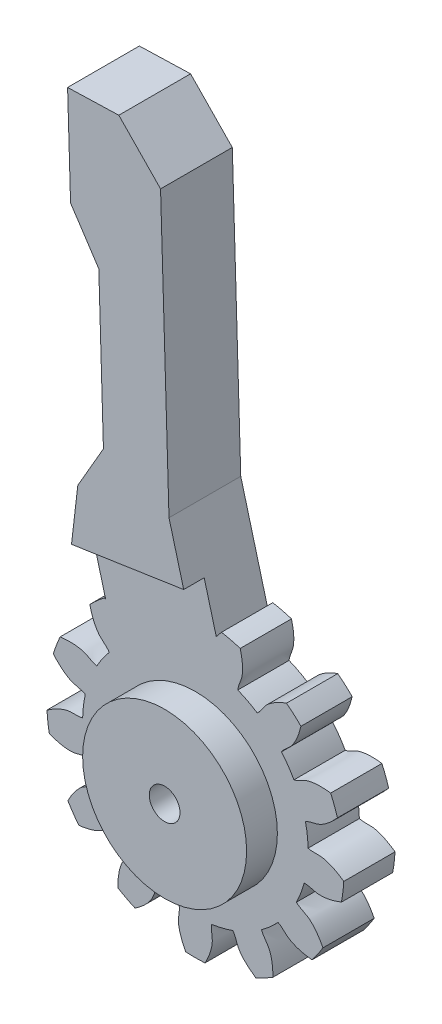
from build123d import *

# Parameters (mm, degrees)
SKETCH_1_R               = 15
SKETCH_1_R_2             = 1.4999999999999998
EXTRUDE_1_DEPTH          = 5
CUT_EXTRUDE_1_DEPTH      = 22.79449471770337
PATTERN_CIRCULAR_1_COUNT = 13
EXTRUDE_START            = -5
SKETCH_6_R               = 11
SKETCH_6_R_2             = 1.4999999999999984
EXTRUDE_3_DEPTH          = 5
EXTRUDE_4_DEPTH          = 5
CUT_EXTRUDE_2_DEPTH      = 10
SKETCH_9_R               = 8
SKETCH_9_R_2             = 1.5
EXTRUDE_5_DEPTH          = 3
EXTRUDE_6_DEPTH          = 2


with BuildPart() as part:
    # Sketch 1 → Extrude 1 (new body)
    with BuildSketch(Plane.XY):
        Circle(SKETCH_1_R)
        Circle(SKETCH_1_R_2, mode=Mode.SUBTRACT)
    extrude(amount=EXTRUDE_1_DEPTH)

    # Sketch 2 → Cut-Extrude 1 (cut, through all)
    with BuildSketch(Plane.XY):
        with BuildLine():
            ThreePointArc((0.7294000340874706, 10.474634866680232), (6.4e-16, 10.5), (-0.7294000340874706, 10.474634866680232))
            add(Edge.make_bspline(
                [(-0.7294000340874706, 10.474634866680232), (-1.3068742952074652, 10.97954116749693), (-1.156674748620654, 11.697253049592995), (-1.339815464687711, 12.341440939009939), (-1.353387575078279, 12.385835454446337), (-1.369367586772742, 12.434593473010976), (-1.3879307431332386, 12.487635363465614), (-1.409255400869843, 12.544875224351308), (-1.4335158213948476, 12.606222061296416), (-1.460884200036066, 12.671579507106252), (-1.4915298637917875, 12.740845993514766), (-1.5256193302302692, 12.813914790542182), (-1.563316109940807, 12.890674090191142), (-1.6047805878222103, 12.971007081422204), (-1.6501698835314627, 13.054792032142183), (-1.6996377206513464, 13.141902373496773), (-1.7533342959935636, 13.232206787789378), (-1.811406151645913, 13.325569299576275), (-1.8739960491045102, 13.421849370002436), (-1.9412428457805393, 13.520901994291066), (-2.013281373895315, 13.622577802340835), (-2.0902423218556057, 13.726723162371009), (-2.1722521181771, 13.833180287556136), (-2.259432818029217, 13.941787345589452), (-2.3519019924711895, 14.052378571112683), (-2.449772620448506, 14.164784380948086), (-2.553152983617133, 14.278831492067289), (-2.6621465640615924, 14.39434304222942), (-2.776851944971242, 14.511138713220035), (-2.8973627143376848, 14.629034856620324), (-3.023767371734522, 14.747844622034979), (-3.156149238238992, 14.867378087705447), (-3.294586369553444, 14.987442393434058), (-3.439151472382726, 15.107841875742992), (-3.5899118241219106, 15.228378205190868), (-3.746929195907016, 15.348850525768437), (-3.91025977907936, 15.469055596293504), (-4.079954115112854, 15.588787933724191), (-4.256057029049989, 15.707839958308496), (-4.438607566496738, 15.826002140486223), (-4.627638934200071, 15.943063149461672), (-4.823178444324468, 16.05881000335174), (-5.025247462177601, 16.173028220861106), (-5.233861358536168, 16.285501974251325), (-5.449029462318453, 16.396014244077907), (-5.670755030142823, 16.504346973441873), (-5.899035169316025, 16.610281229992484), (-6.21511813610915, 16.749347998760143), (-6.457531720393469, 16.84735466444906), (-6.621879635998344, 16.910076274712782)],
                knots=[0, 0, 0, 0, 0.20982741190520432, 0.21436403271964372, 0.2194343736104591, 0.2250384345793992, 0.23117621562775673, 0.23784771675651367, 0.2450529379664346, 0.25279187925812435, 0.26106454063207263, 0.26987092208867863, 0.2792110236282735, 0.28908484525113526, 0.29949238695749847, 0.3104336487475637, 0.3219086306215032, 0.33391733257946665, 0.34645975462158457, 0.3595358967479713, 0.37314575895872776, 0.3872893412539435, 0.40196664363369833, 0.4171776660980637, 0.4329224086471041, 0.4492008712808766, 0.4660130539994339, 0.48335895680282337, 0.5012385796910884, 0.5196519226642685, 0.5385989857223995, 0.5580797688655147, 0.5780942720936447, 0.5986424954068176, 0.6197244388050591, 0.6413401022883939, 0.663489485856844, 0.6861725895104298, 0.7093894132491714, 0.733139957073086, 0.7574242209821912, 0.782242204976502, 0.8075939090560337, 0.8334793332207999, 0.8598984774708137, 0.8868513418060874, 0.9143379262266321, 0.9423582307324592, 1, 1, 1, 1], degree=3))
            ThreePointArc((-6.621879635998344, 16.910076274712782), (1.11e-15, 18.16039563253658), (6.621879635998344, 16.910076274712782))
            add(Edge.make_bspline(
                [(0.7294000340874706, 10.474634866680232), (1.3068742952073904, 10.97954116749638), (1.156674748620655, 11.69725304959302), (1.339815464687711, 12.341440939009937), (1.3533875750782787, 12.385835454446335), (1.369367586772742, 12.43459347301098), (1.3879307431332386, 12.487635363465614), (1.409255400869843, 12.544875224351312), (1.4335158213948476, 12.606222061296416), (1.460884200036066, 12.671579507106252), (1.4915298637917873, 12.740845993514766), (1.5256193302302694, 12.813914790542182), (1.563316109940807, 12.890674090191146), (1.6047805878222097, 12.971007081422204), (1.6501698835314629, 13.054792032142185), (1.6996377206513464, 13.141902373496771), (1.7533342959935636, 13.232206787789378), (1.811406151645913, 13.325569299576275), (1.8739960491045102, 13.421849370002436), (1.9412428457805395, 13.520901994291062), (2.013281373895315, 13.622577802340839), (2.090242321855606, 13.72672316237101), (2.1722521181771, 13.833180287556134), (2.259432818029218, 13.941787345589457), (2.351901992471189, 14.052378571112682), (2.4497726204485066, 14.164784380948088), (2.5531529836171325, 14.278831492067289), (2.6621465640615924, 14.39434304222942), (2.776851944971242, 14.511138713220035), (2.897362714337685, 14.629034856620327), (3.023767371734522, 14.747844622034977), (3.156149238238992, 14.867378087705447), (3.294586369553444, 14.987442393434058), (3.439151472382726, 15.107841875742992), (3.5899118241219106, 15.228378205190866), (3.746929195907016, 15.348850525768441), (3.91025977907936, 15.469055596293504), (4.079954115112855, 15.588787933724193), (4.256057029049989, 15.707839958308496), (4.438607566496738, 15.826002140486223), (4.627638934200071, 15.943063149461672), (4.823178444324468, 16.05881000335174), (5.0252474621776, 16.173028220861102), (5.233861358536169, 16.28550197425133), (5.449029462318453, 16.396014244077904), (5.670755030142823, 16.504346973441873), (5.899035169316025, 16.610281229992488), (6.21511813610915, 16.74934799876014), (6.457531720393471, 16.847354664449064), (6.621879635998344, 16.910076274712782)],
                knots=[0, 0, 0, 0, 0.20982741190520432, 0.21436403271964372, 0.2194343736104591, 0.2250384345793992, 0.23117621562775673, 0.23784771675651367, 0.2450529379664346, 0.25279187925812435, 0.26106454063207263, 0.26987092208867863, 0.2792110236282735, 0.28908484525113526, 0.29949238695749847, 0.3104336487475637, 0.3219086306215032, 0.33391733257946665, 0.34645975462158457, 0.3595358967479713, 0.37314575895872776, 0.3872893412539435, 0.40196664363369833, 0.4171776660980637, 0.4329224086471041, 0.4492008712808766, 0.4660130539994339, 0.48335895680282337, 0.5012385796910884, 0.5196519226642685, 0.5385989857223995, 0.5580797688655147, 0.5780942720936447, 0.5986424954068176, 0.6197244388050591, 0.6413401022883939, 0.663489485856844, 0.6861725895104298, 0.7093894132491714, 0.733139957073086, 0.7574242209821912, 0.782242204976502, 0.8075939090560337, 0.8334793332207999, 0.8598984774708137, 0.8868513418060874, 0.9143379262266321, 0.9423582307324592, 1, 1, 1, 1], degree=3))
        make_face()
    cut_extrude_1 = extrude(amount=CUT_EXTRUDE_1_DEPTH, mode=Mode.SUBTRACT)

    # Pattern Circular 1: Cut-Extrude 1 ×13 about axis
    pattern_circular_1_axis = Axis((0, 0, 5), (0, 0, -1))
    for i in range(1, PATTERN_CIRCULAR_1_COUNT):
        add(cut_extrude_1.rotate(pattern_circular_1_axis, i * 360 / PATTERN_CIRCULAR_1_COUNT), mode=Mode.SUBTRACT)

    # Sketch 6 → Extrude 3 (add)
    with BuildSketch(Plane.XY.offset(5).offset(EXTRUDE_START)):
        Circle(SKETCH_6_R)
        Circle(SKETCH_6_R_2, mode=Mode.SUBTRACT)
    extrude(amount=EXTRUDE_3_DEPTH)

    # Sketch 7 → Extrude 4 (add)
    with BuildSketch(Plane.XY):
        with BuildLine():
            Line((5.460118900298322, 0.8729270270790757), (0.5399688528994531, 19.235176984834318))
            Line((0.5399688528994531, 19.235176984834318), (-0.5728595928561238, 23.3883092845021))
            Line((-0.5728595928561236, 23.3883092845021), (-1.1087281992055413, 41.19555433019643))
            Line((-1.1087281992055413, 41.19555433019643), (-1.3966429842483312, 50.76314061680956))
            Line((-1.3966429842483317, 50.76314061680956), (-5.468867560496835, 54.950560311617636))
            Line((-5.468867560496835, 54.950560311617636), (-10.466605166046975, 54.800164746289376))
            Line((-10.466605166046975, 54.800164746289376), (-10.40774198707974, 52.84410492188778))
            Line((-10.40774198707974, 52.84410492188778), (-10.177034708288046, 45.17755943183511))
            Line((-10.177034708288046, 45.17755943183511), (-7.421183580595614, 41.005595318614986))
            Line((-7.421183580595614, 41.005595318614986), (-6.969996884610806, 26.012382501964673))
            Line((-6.969996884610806, 26.012382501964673), (-9.469996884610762, 21.682255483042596))
            Line((-9.469996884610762, 21.682255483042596), (-10.085215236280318, 16.388167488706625))
            Line((-10.085215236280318, 16.388167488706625), (-5.165065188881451, -1.9740824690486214))
            ThreePointArc((-5.165065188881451, -1.9740824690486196), (1.5710316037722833, -5.863169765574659), (5.460118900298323, 0.8729270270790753))
        make_face()
        with BuildLine():
            ThreePointArc((1.5000000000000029, -3.7e-16), (0.19578928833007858, -1.4871672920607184), (-1.4488887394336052, -0.38822856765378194))
            ThreePointArc((-1.4488887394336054, -0.3882285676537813), (-1.2990381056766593, 0.7500000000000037), (-0.38822856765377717, 1.4488887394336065))
            ThreePointArc((-0.38822856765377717, 1.4488887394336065), (0.9131421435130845, 1.1900300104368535), (1.5000000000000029, 0))
        make_face(mode=Mode.SUBTRACT)
    extrude(amount=EXTRUDE_4_DEPTH)

    # Sketch 8 → Cut-Extrude 2 (cut)
    with BuildSketch(Plane(origin=(0, 0, 0), x_dir=(-1, 0, 0), z_dir=(0, 0, -1))):
        with BuildLine():
            ThreePointArc((-4.376042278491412, 13.823901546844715), (-3.470077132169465, 14.078656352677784), (-2.5494943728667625, 14.274105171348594))
            add(Edge.make_bspline(
                [(-2.549494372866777, 14.274105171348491), (-2.5504725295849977, 14.275164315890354), (-2.5873768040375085, 14.3151019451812), (-2.6621465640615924, 14.39434304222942), (-2.776851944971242, 14.511138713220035), (-2.881836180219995, 14.613845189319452), (-2.9488485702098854, 14.677313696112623), (-2.975214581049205, 14.701975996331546)],
                knots=[0.4655406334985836, 0.4655406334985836, 0.4655406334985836, 0.4655406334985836, 0.4660130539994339, 0.48335895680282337, 0.5012385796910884, 0.5196519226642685, 0.5314818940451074, 0.5314818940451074, 0.5314818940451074, 0.5314818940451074], degree=3))
            ThreePointArc((-2.9752145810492, 14.701975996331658), (-3.589734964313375, 14.56412726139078), (-4.197927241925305, 14.400604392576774))
            add(Edge.make_bspline(
                [(-4.3760422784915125, 13.823901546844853), (-4.3756683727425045, 13.82529394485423), (-4.361551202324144, 13.877807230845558), (-4.33217104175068, 13.98271897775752), (-4.284882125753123, 14.139442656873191), (-4.239653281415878, 14.279173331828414), (-4.209812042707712, 14.366514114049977), (-4.197927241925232, 14.400604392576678)],
                knots=[0.46554063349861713, 0.46554063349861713, 0.46554063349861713, 0.46554063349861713, 0.4660130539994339, 0.48335895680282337, 0.5012385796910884, 0.5196519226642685, 0.5314818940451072, 0.5314818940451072, 0.5314818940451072, 0.5314818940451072], degree=3))
        make_face()
        with BuildLine():
            ThreePointArc((-10.299080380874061, 10.206808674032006), (-9.615278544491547, 10.853405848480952), (-8.890972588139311, 11.454283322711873))
            add(Edge.make_bspline(
                [(-8.890972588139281, 11.454283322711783), (-8.892330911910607, 11.454766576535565), (-8.943567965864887, 11.472979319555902), (-9.046598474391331, 11.508396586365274), (-9.202442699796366, 11.558507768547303), (-9.343131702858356, 11.600661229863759), (-9.431963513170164, 11.625717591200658), (-9.46677059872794, 11.63530207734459)],
                knots=[0.4655406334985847, 0.4655406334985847, 0.4655406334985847, 0.4655406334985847, 0.4660130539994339, 0.48335895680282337, 0.5012385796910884, 0.5196519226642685, 0.5314818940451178, 0.5314818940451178, 0.5314818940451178, 0.5314818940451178], degree=3))
            ThreePointArc((-9.466770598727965, 11.635302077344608), (-9.946839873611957, 11.227661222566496), (-10.4093745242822, 10.800227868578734))
            add(Edge.make_bspline(
                [(-10.299080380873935, 10.206808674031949), (-10.299396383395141, 10.208215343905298), (-10.311300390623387, 10.261274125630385), (-10.334040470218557, 10.367822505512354), (-10.365001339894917, 10.528570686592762), (-10.389889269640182, 10.673314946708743), (-10.40405545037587, 10.764519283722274), (-10.409374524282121, 10.800227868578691)],
                knots=[0.46554063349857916, 0.46554063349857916, 0.46554063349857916, 0.46554063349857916, 0.4660130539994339, 0.48335895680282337, 0.5012385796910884, 0.5196519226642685, 0.5314818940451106, 0.5314818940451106, 0.5314818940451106, 0.5314818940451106], degree=3))
        make_face()
        with BuildLine():
            add(Edge.make_bspline(
                [(8.890972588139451, 11.454283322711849), (8.892330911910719, 11.45476657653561), (8.943567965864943, 11.472979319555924), (9.04659847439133, 11.508396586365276), (9.202442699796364, 11.558507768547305), (9.343131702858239, 11.600661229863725), (9.431963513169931, 11.625717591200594), (9.466770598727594, 11.635302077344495)],
                knots=[0.46554063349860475, 0.46554063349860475, 0.46554063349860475, 0.46554063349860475, 0.4660130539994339, 0.48335895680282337, 0.5012385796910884, 0.5196519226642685, 0.5314818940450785, 0.5314818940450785, 0.5314818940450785, 0.5314818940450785], degree=3))
            ThreePointArc((8.89097258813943, 11.454283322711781), (9.6152785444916, 10.853405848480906), (10.299080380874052, 10.206808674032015))
            add(Edge.make_bspline(
                [(10.299080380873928, 10.206808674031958), (10.299396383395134, 10.208215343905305), (10.31130039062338, 10.26127412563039), (10.334040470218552, 10.36782250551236), (10.36500133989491, 10.528570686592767), (10.389889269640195, 10.673314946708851), (10.404055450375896, 10.764519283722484), (10.40937452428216, 10.800227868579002)],
                knots=[0.4655406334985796, 0.4655406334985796, 0.4655406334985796, 0.4655406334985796, 0.4660130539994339, 0.48335895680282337, 0.5012385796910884, 0.5196519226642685, 0.5314818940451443, 0.5314818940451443, 0.5314818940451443, 0.5314818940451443], degree=3))
            ThreePointArc((10.409374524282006, 10.800227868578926), (9.94683987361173, 11.227661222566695), (9.46677059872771, 11.635302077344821))
        make_face()
        with BuildLine():
            ThreePointArc((-13.862723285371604, 4.2514589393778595), (-13.557735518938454, 5.1417708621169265), (-13.195636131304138, 6.010423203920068))
            add(Edge.make_bspline(
                [(-13.195636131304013, 6.010423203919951), (-13.19706344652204, 6.010219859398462), (-13.250895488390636, 6.002535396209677), (-13.358583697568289, 5.986015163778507), (-13.519864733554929, 5.957961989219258), (-13.664028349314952, 5.929905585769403), (-13.754329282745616, 5.910809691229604), (-13.789603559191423, 5.903120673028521)],
                knots=[0.4655406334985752, 0.4655406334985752, 0.4655406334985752, 0.4655406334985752, 0.4660130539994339, 0.48335895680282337, 0.5012385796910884, 0.5196519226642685, 0.5314818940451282, 0.5314818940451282, 0.5314818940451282, 0.5314818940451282], degree=3))
            ThreePointArc((-13.789603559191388, 5.903120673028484), (-14.02524364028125, 5.319073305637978), (-14.236159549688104, 4.7256492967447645))
            add(Edge.make_bspline(
                [(-13.862723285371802, 4.251458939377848), (-13.863656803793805, 4.252557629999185), (-13.898854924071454, 4.294006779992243), (-13.968505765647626, 4.377782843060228), (-14.070623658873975, 4.505730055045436), (-14.159926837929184, 4.622328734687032), (-14.214855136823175, 4.69650281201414), (-14.236159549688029, 4.725649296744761)],
                knots=[0.4655406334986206, 0.4655406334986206, 0.4655406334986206, 0.4655406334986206, 0.4660130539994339, 0.48335895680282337, 0.5012385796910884, 0.5196519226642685, 0.5314818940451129, 0.5314818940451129, 0.5314818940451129, 0.5314818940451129], degree=3))
        make_face()
        with BuildLine():
            add(Edge.make_bspline(
                [(13.195636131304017, 6.010423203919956), (13.19706344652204, 6.010219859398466), (13.250895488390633, 6.002535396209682), (13.358583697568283, 5.986015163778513), (13.519864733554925, 5.957961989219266), (13.664028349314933, 5.929905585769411), (13.754329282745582, 5.910809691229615), (13.789603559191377, 5.903120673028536)],
                knots=[0.4655406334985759, 0.4655406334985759, 0.4655406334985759, 0.4655406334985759, 0.4660130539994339, 0.48335895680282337, 0.5012385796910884, 0.5196519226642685, 0.531481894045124, 0.531481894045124, 0.531481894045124, 0.531481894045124], degree=3))
            ThreePointArc((13.195636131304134, 6.010423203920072), (13.557735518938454, 5.1417708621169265), (13.862723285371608, 4.251458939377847))
            add(Edge.make_bspline(
                [(13.862723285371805, 4.251458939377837), (13.863656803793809, 4.252557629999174), (13.898854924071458, 4.294006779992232), (13.96850576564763, 4.377782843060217), (14.070623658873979, 4.505730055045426), (14.159926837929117, 4.622328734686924), (14.214855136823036, 4.696502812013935), (14.236159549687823, 4.725649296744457)],
                knots=[0.4655406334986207, 0.4655406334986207, 0.4655406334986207, 0.4655406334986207, 0.4660130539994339, 0.48335895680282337, 0.5012385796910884, 0.5196519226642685, 0.5314818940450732, 0.5314818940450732, 0.5314818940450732, 0.5314818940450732], degree=3))
            ThreePointArc((14.23615954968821, 4.725649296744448), (14.025243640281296, 5.319073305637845), (13.78960355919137, 5.903120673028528))
        make_face()
        with BuildLine():
            ThreePointArc((-14.250583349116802, -2.6778488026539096), (-14.394278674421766, -1.7477818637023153), (-14.477338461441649, -0.8103524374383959))
            add(Edge.make_bspline(
                [(-14.47733846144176, -0.8103524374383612), (-14.478507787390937, -0.8111957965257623), (-14.522602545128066, -0.8430170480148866), (-14.610278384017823, -0.907690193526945), (-14.740048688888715, -1.0074810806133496), (-14.854660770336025, -1.09931996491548), (-14.925743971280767, -1.1581934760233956), (-14.953404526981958, -1.181394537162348)],
                knots=[0.46554063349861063, 0.46554063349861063, 0.46554063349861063, 0.46554063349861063, 0.4660130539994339, 0.48335895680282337, 0.5012385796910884, 0.5196519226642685, 0.5314818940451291, 0.5314818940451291, 0.5314818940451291, 0.5314818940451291], degree=3))
            ThreePointArc((-14.953404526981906, -1.1813945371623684), (-14.890633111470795, -1.8080502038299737), (-14.80161198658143, -2.4315185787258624))
            add(Edge.make_bspline(
                [(-14.250583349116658, -2.677848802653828), (-14.251920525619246, -2.6773097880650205), (-14.302349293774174, -2.65696577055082), (-14.40295472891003, -2.615154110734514), (-14.552835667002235, -2.549319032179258), (-14.686095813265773, -2.4875772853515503), (-14.769202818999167, -2.447425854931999), (-14.801611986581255, -2.431518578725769)],
                knots=[0.46554063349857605, 0.46554063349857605, 0.46554063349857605, 0.46554063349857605, 0.4660130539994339, 0.48335895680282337, 0.5012385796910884, 0.5196519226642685, 0.5314818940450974, 0.5314818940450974, 0.5314818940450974, 0.5314818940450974], degree=3))
        make_face()
        with BuildLine():
            ThreePointArc((-11.373806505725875, -8.993693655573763), (-11.933266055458, -8.236938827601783), (-12.442457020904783, -7.445486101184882))
            add(Edge.make_bspline(
                [(-12.442457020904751, -7.445486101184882), (-12.443100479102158, -7.4467762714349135), (-12.467356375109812, -7.495444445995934), (-12.51493436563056, -7.593454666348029), (-12.583465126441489, -7.742122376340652), (-12.642269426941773, -7.876704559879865), (-12.677850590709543, -7.9618684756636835), (-12.691560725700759, -7.995266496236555)],
                knots=[0.4655406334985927, 0.4655406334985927, 0.4655406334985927, 0.4655406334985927, 0.4660130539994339, 0.48335895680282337, 0.5012385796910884, 0.5196519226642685, 0.5314818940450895, 0.5314818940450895, 0.5314818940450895, 0.5314818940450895], degree=3))
            ThreePointArc((-12.691560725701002, -7.995266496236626), (-12.344757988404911, -8.520971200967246), (-11.976193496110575, -9.03165485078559))
            add(Edge.make_bspline(
                [(-11.373806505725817, -8.99369365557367), (-11.375241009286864, -8.99383779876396), (-11.429347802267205, -8.999259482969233), (-11.537860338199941, -9.008990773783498), (-11.701168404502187, -9.020349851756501), (-11.847857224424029, -9.027609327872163), (-11.940104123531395, -9.03067875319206), (-11.976193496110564, -9.031654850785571)],
                knots=[0.46554063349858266, 0.46554063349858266, 0.46554063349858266, 0.46554063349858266, 0.4660130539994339, 0.48335895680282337, 0.5012385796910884, 0.5196519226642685, 0.5314818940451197, 0.5314818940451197, 0.5314818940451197, 0.5314818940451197], degree=3))
        make_face()
        with BuildLine():
            add(Edge.make_bspline(
                [(14.477338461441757, -0.8103524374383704), (14.478507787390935, -0.8111957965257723), (14.522602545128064, -0.8430170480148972), (14.610278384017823, -0.9076901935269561), (14.740048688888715, -1.0074810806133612), (14.85466077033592, -1.0993199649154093), (14.925743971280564, -1.1581934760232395), (14.953404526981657, -1.1813945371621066)],
                knots=[0.4655406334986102, 0.4655406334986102, 0.4655406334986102, 0.4655406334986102, 0.4660130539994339, 0.48335895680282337, 0.5012385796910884, 0.5196519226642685, 0.5314818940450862, 0.5314818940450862, 0.5314818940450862, 0.5314818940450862], degree=3))
            ThreePointArc((14.477338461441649, -0.8103524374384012), (14.394278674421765, -1.7477818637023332), (14.250583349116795, -2.67784880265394))
            add(Edge.make_bspline(
                [(14.250583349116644, -2.6778488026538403), (14.251920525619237, -2.677309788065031), (14.30234929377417, -2.6569657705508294), (14.40295472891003, -2.6151541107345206), (14.552835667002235, -2.5493190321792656), (14.686095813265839, -2.487577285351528), (14.769202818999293, -2.4474258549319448), (14.801611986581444, -2.431518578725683)],
                knots=[0.4655406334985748, 0.4655406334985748, 0.4655406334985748, 0.4655406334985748, 0.4660130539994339, 0.48335895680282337, 0.5012385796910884, 0.5196519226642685, 0.5314818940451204, 0.5314818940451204, 0.5314818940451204, 0.5314818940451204], degree=3))
            ThreePointArc((14.801611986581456, -2.43151857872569), (14.890633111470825, -1.8080502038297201), (14.95340452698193, -1.1813945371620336))
        make_face()
        with BuildLine():
            ThreePointArc((-5.891427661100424, -13.249191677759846), (-6.738485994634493, -12.839112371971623), (-7.5571586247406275, -12.374948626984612))
            add(Edge.make_bspline(
                [(-7.55715862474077, -12.374948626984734), (-7.5571288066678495, -12.376390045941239), (-7.555989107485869, -12.430755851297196), (-7.552569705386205, -12.539650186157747), (-7.544161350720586, -12.703136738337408), (-7.53368651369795, -12.849631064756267), (-7.525614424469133, -12.941575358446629), (-7.522233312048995, -12.977519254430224)],
                knots=[0.465540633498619, 0.465540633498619, 0.465540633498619, 0.465540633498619, 0.4660130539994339, 0.48335895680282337, 0.5012385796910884, 0.5196519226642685, 0.5314818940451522, 0.5314818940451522, 0.5314818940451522, 0.5314818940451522], degree=3))
            ThreePointArc((-7.522233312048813, -12.977519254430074), (-6.970847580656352, -13.281840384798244), (-6.40717340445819, -13.562747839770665))
            add(Edge.make_bspline(
                [(-5.891427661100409, -13.249191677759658), (-5.892630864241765, -13.24998595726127), (-5.938020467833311, -13.279931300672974), (-6.0295811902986, -13.338976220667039), (-6.168904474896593, -13.424927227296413), (-6.2954173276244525, -13.49952486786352), (-6.3756714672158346, -13.545111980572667), (-6.407173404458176, -13.562747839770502)],
                knots=[0.4655406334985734, 0.4655406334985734, 0.4655406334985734, 0.4655406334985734, 0.4660130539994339, 0.48335895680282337, 0.5012385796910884, 0.5196519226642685, 0.5314818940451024, 0.5314818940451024, 0.5314818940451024, 0.5314818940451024], degree=3))
        make_face()
        with BuildLine():
            add(Edge.make_bspline(
                [(12.44245702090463, -7.4454861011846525), (12.443100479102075, -7.446776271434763), (12.467356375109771, -7.495444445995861), (12.514934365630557, -7.593454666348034), (12.583465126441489, -7.742122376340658), (12.64226942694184, -7.876704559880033), (12.677850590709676, -7.961868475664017), (12.69156072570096, -7.995266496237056)],
                knots=[0.46554063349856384, 0.46554063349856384, 0.46554063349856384, 0.46554063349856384, 0.4660130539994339, 0.48335895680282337, 0.5012385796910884, 0.5196519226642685, 0.531481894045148, 0.531481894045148, 0.531481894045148, 0.531481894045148], degree=3))
            ThreePointArc((12.442457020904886, -7.445486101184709), (11.933266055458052, -8.236938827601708), (11.373806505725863, -8.993693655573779))
            add(Edge.make_bspline(
                [(11.373806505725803, -8.993693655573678), (11.375241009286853, -8.993837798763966), (11.429347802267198, -8.999259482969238), (11.537860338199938, -9.008990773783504), (11.701168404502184, -9.020349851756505), (11.847857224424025, -9.02760932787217), (11.94010412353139, -9.030678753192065), (11.976193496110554, -9.031654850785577)],
                knots=[0.4655406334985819, 0.4655406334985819, 0.4655406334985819, 0.4655406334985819, 0.4660130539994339, 0.48335895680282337, 0.5012385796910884, 0.5196519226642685, 0.5314818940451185, 0.5314818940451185, 0.5314818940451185, 0.5314818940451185], degree=3))
            ThreePointArc((11.976193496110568, -9.031654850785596), (12.34475798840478, -8.520971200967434), (12.691560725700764, -7.995266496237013))
        make_face()
        with BuildLine():
            ThreePointArc((0.9406062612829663, -14.469459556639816), (-2.66e-15, -14.5), (-0.9406062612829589, -14.469459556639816))
            add(Edge.make_bspline(
                [(-0.9406062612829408, -14.469459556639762), (-0.939909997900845, -14.470722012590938), (-0.9136357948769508, -14.518330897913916), (-0.8600023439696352, -14.613162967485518), (-0.7765811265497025, -14.754015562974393), (-0.6992268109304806, -14.87886194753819), (-0.6493506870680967, -14.956523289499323), (-0.6296528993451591, -14.98677874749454)],
                knots=[0.46554063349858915, 0.46554063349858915, 0.46554063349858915, 0.46554063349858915, 0.4660130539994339, 0.48335895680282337, 0.5012385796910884, 0.5196519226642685, 0.5314818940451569, 0.5314818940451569, 0.5314818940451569, 0.5314818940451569], degree=3))
            ThreePointArc((-0.6296528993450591, -14.986778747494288), (2.0586e-13, -15.000000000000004), (0.6296528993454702, -14.98677874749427))
            add(Edge.make_bspline(
                [(0.940606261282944, -14.46945955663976), (0.939909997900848, -14.470722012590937), (0.9136357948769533, -14.518330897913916), (0.8600023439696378, -14.613162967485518), (0.7765811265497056, -14.754015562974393), (0.6992268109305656, -14.878861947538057), (0.649350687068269, -14.95652328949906), (0.6296528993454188, -14.986778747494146)],
                knots=[0.465540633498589, 0.465540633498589, 0.465540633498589, 0.465540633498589, 0.4660130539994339, 0.48335895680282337, 0.5012385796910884, 0.5196519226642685, 0.5314818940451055, 0.5314818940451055, 0.5314818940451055, 0.5314818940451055], degree=3))
        make_face()
        with BuildLine():
            add(Edge.make_bspline(
                [(7.557158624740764, -12.374948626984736), (7.557128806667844, -12.37639004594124), (7.555989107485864, -12.4307558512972), (7.552569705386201, -12.539650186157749), (7.544161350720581, -12.703136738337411), (7.533686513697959, -12.84963106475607), (7.525614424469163, -12.941575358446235), (7.522233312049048, -12.977519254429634)],
                knots=[0.4655406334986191, 0.4655406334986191, 0.4655406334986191, 0.4655406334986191, 0.4660130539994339, 0.48335895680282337, 0.5012385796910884, 0.5196519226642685, 0.5314818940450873, 0.5314818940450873, 0.5314818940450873, 0.5314818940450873], degree=3))
            ThreePointArc((7.557158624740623, -12.374948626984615), (6.738485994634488, -12.839112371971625), (5.89142766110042, -13.24919167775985))
            add(Edge.make_bspline(
                [(5.891427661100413, -13.249191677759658), (5.892630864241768, -13.24998595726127), (5.938020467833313, -13.279931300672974), (6.029581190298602, -13.338976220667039), (6.168904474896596, -13.424927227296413), (6.2954173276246, -13.499524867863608), (6.375671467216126, -13.54511198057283), (6.407173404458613, -13.562747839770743)],
                knots=[0.4655406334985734, 0.4655406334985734, 0.4655406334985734, 0.4655406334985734, 0.4660130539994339, 0.48335895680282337, 0.5012385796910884, 0.5196519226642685, 0.5314818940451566, 0.5314818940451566, 0.5314818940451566, 0.5314818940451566], degree=3))
            ThreePointArc((6.407173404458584, -13.562747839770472), (6.970847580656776, -13.28184038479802), (7.522233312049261, -12.977519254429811))
        make_face()
    extrude(amount=-CUT_EXTRUDE_2_DEPTH, mode=Mode.SUBTRACT)

    # Sketch 9 → Extrude 5 (add)
    with BuildSketch(Plane.XY.offset(5)):
        Circle(SKETCH_9_R)
        Circle(SKETCH_9_R_2, mode=Mode.SUBTRACT)
    extrude(amount=EXTRUDE_5_DEPTH)

    # Sketch 10 → Extrude 6 (add)
    with BuildSketch(Plane.XY.offset(5)):
        Polygon((0.8605759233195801, 18.0386551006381), (-0.5728595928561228, 23.3883092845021), (-1.3966429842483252, 50.76314061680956), (-5.468867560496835, 54.95056031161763), (-10.466605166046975, 54.80016474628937), (-10.177034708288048, 45.17755943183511), (-7.4211835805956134, 41.005595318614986), (-6.969996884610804, 26.012382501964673), (-9.469996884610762, 21.682255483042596), (-10.085215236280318, 16.388167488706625), align=None)
    extrude(amount=EXTRUDE_6_DEPTH)


solid = part.part
